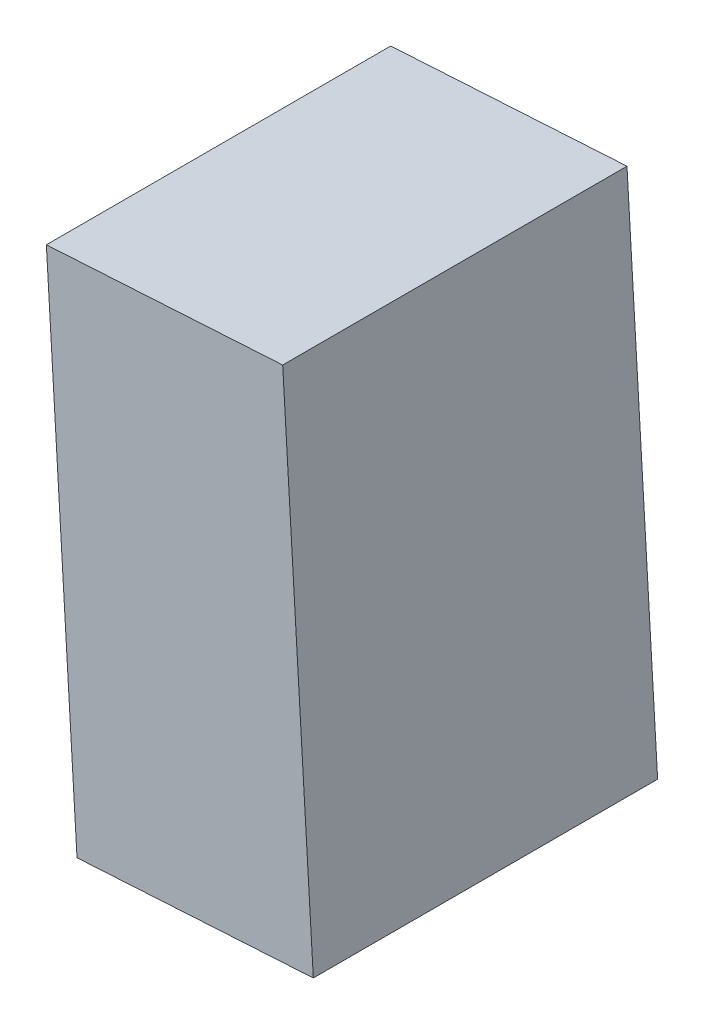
from build123d import *

# Parameters (mm, degrees)
BOSS_EXTRUDE1_DEPTH = 406.4


with BuildPart() as part:
    # Sketch1 → Boss-Extrude1 (new body)
    with BuildSketch(Plane.XY):
        Polygon((-484.304777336, -558.736635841), (-520.471063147, 49.789583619), (-799.378913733, 33.213369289), (-763.212627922, -575.312850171), align=None)
    extrude(amount=-BOSS_EXTRUDE1_DEPTH)


solid = part.part
